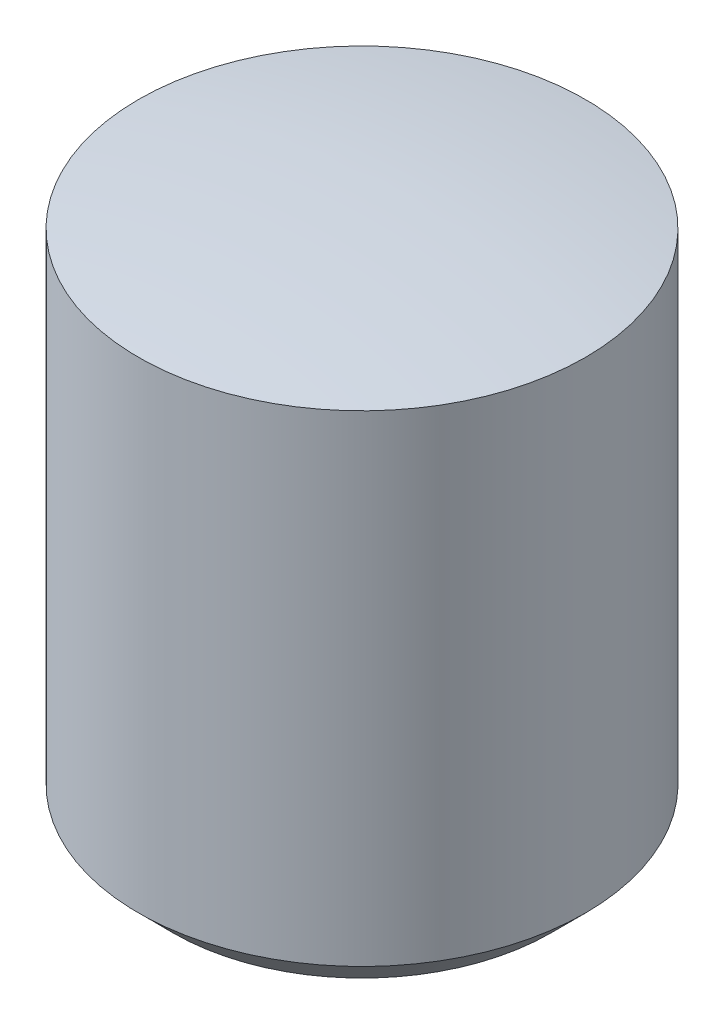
from build123d import *

# Parameters (mm, degrees)
TROU_TARAUD_M61_D     = 5
TROU_TARAUD_M61_DEPTH = 12
TROU_TARAUD_M61_TIP   = 1.502151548
CHANFREIN1_SIZE       = 1


with BuildPart() as part:
    # Esquisse2 → R_volution1 (revolve)
    with BuildSketch(Plane.XY):
        with BuildLine():
            Line((0, 0), (0, 15.5))
            ThreePointArc((0, 15.5), (-3.259601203, 15.374815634), (-6.5, 15))
            Line((-6.5, 15), (-6.5, 0))
            Line((-6.5, 0), (0, 0))
        make_face()
    revolve(axis=Axis((0, 0, 0), (0, 1, 0)))

    # Trou taraud_ M61
    with Locations(Plane.XZ):
        with Locations((0, 0)):
            Hole(TROU_TARAUD_M61_D / 2, depth=TROU_TARAUD_M61_DEPTH)
            with Locations((0, 0, -(TROU_TARAUD_M61_DEPTH + TROU_TARAUD_M61_TIP / 2))):  # 118° drill point
                Cone(0, TROU_TARAUD_M61_D / 2, TROU_TARAUD_M61_TIP, mode=Mode.SUBTRACT)

    # Chanfrein1
    chanfrein1_edges = [part.edges().sort_by_distance(p)[0] for p in [
        (6.5, 0, 0),
    ]]
    chamfer(chanfrein1_edges, length=CHANFREIN1_SIZE)


solid = part.part
